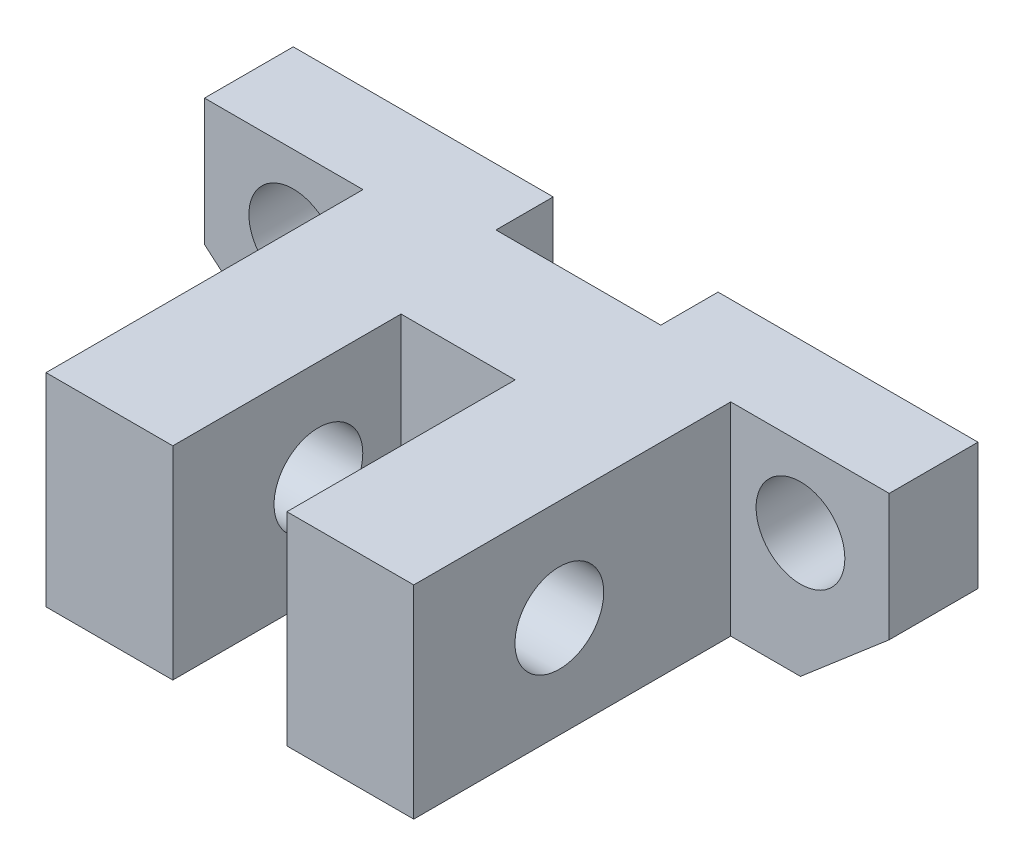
ISO-10303-21;
HEADER;
FILE_DESCRIPTION(('STEP AP214'),'2;1');
FILE_NAME('part.step','',(''),(''),'','','');
FILE_SCHEMA(('AUTOMOTIVE_DESIGN { 1 0 10303 214 1 1 1 1 }'));
ENDSEC;
DATA;
#1=APPLICATION_CONTEXT('core data for automotive mechanical design processes');
#2=APPLICATION_PROTOCOL_DEFINITION('international standard','automotive_design',2000,#1);
#3=PRODUCT_CONTEXT('',#1,'mechanical');
#4=PRODUCT('Part','Part','',(#3));
#5=PRODUCT_RELATED_PRODUCT_CATEGORY('part','',(#4));
#6=PRODUCT_DEFINITION_FORMATION('','',#4);
#7=PRODUCT_DEFINITION_CONTEXT('part definition',#1,'design');
#8=PRODUCT_DEFINITION('design','',#6,#7);
#9=PRODUCT_DEFINITION_SHAPE('','',#8);
#10=(LENGTH_UNIT() NAMED_UNIT(*) SI_UNIT(.MILLI.,.METRE.));
#11=(NAMED_UNIT(*) PLANE_ANGLE_UNIT() SI_UNIT($,.RADIAN.));
#12=(NAMED_UNIT(*) SI_UNIT($,.STERADIAN.) SOLID_ANGLE_UNIT());
#13=UNCERTAINTY_MEASURE_WITH_UNIT(LENGTH_MEASURE(1.E-05),#10,'distance_accuracy_value','');
#14=(GEOMETRIC_REPRESENTATION_CONTEXT(3) GLOBAL_UNCERTAINTY_ASSIGNED_CONTEXT((#13)) GLOBAL_UNIT_ASSIGNED_CONTEXT((#10,
#11,#12)) REPRESENTATION_CONTEXT('',''));
#15=CARTESIAN_POINT('',(0.,0.,0.));
#16=DIRECTION('',(0.,0.,1.));
#17=DIRECTION('',(1.,0.,0.));
#18=AXIS2_PLACEMENT_3D('',#15,#16,#17);
#19=CARTESIAN_POINT('',(0.,0.,0.));
#20=DIRECTION('',(0.,0.,1.));
#21=DIRECTION('',(1.,0.,0.));
#22=AXIS2_PLACEMENT_3D('',#19,#20,#21);
#23=PLANE('',#22);
#24=CARTESIAN_POINT('',(20.,1.79750346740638,0.));
#25=DIRECTION('',(0.,0.,1.));
#26=DIRECTION('',(1.,0.,0.));
#27=AXIS2_PLACEMENT_3D('',#24,#25,#26);
#28=CIRCLE('',#27,3.5);
#29=CARTESIAN_POINT('',(23.5,1.79750346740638,0.));
#30=VERTEX_POINT('',#29);
#31=EDGE_CURVE('E242',#30,#30,#28,.T.);
#32=ORIENTED_EDGE('',*,*,#31,.T.);
#33=EDGE_LOOP('',(#32));
#34=FACE_BOUND('',#33,.T.);
#35=DIRECTION('',(1.,0.,0.));
#36=VECTOR('',#35,1.);
#37=CARTESIAN_POINT('',(-20.,-8.,0.));
#38=LINE('',#37,#36);
#39=CARTESIAN_POINT('',(6.5,-8.,0.));
#40=VERTEX_POINT('',#39);
#41=CARTESIAN_POINT('',(20.,-8.,0.));
#42=VERTEX_POINT('',#41);
#43=EDGE_CURVE('E276',#40,#42,#38,.T.);
#44=ORIENTED_EDGE('',*,*,#43,.F.);
#45=DIRECTION('',(0.,1.,0.));
#46=VECTOR('',#45,1.);
#47=CARTESIAN_POINT('',(6.5,0.,0.));
#48=LINE('',#47,#46);
#49=CARTESIAN_POINT('',(6.5,8.,0.));
#50=VERTEX_POINT('',#49);
#51=EDGE_CURVE('E171',#40,#50,#48,.T.);
#52=ORIENTED_EDGE('',*,*,#51,.T.);
#53=DIRECTION('',(-1.,0.,0.));
#54=VECTOR('',#53,1.);
#55=CARTESIAN_POINT('',(-27.,8.,0.));
#56=LINE('',#55,#54);
#57=CARTESIAN_POINT('',(27.,8.,0.));
#58=VERTEX_POINT('',#57);
#59=EDGE_CURVE('E259',#58,#50,#56,.T.);
#60=ORIENTED_EDGE('',*,*,#59,.F.);
#61=DIRECTION('',(0.,1.,0.));
#62=VECTOR('',#61,1.);
#63=CARTESIAN_POINT('',(27.,8.,0.));
#64=LINE('',#63,#62);
#65=CARTESIAN_POINT('',(27.,-2.,0.));
#66=VERTEX_POINT('',#65);
#67=EDGE_CURVE('E281',#66,#58,#64,.T.);
#68=ORIENTED_EDGE('',*,*,#67,.F.);
#69=DIRECTION('',(0.759256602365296,0.650791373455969,0.));
#70=VECTOR('',#69,1.);
#71=CARTESIAN_POINT('',(20.,-8.,0.));
#72=LINE('',#71,#70);
#73=EDGE_CURVE('E279',#42,#66,#72,.T.);
#74=ORIENTED_EDGE('',*,*,#73,.F.);
#75=EDGE_LOOP('',(#44,#52,#60,#68,#74));
#76=FACE_BOUND('',#75,.T.);
#77=ADVANCED_FACE('F39',(#34,#76),#23,.F.);
#78=CARTESIAN_POINT('',(0.,0.,32.));
#79=DIRECTION('',(0.,0.,1.));
#80=DIRECTION('',(1.,0.,0.));
#81=AXIS2_PLACEMENT_3D('',#78,#79,#80);
#82=PLANE('',#81);
#83=DIRECTION('',(0.,1.,0.));
#84=VECTOR('',#83,1.);
#85=CARTESIAN_POINT('',(4.5,0.,32.));
#86=LINE('',#85,#84);
#87=CARTESIAN_POINT('',(4.5,-8.,32.));
#88=VERTEX_POINT('',#87);
#89=CARTESIAN_POINT('',(4.5,8.,32.));
#90=VERTEX_POINT('',#89);
#91=EDGE_CURVE('E305',#88,#90,#86,.T.);
#92=ORIENTED_EDGE('',*,*,#91,.F.);
#93=DIRECTION('',(1.,0.,0.));
#94=VECTOR('',#93,1.);
#95=CARTESIAN_POINT('',(-14.5,-8.,32.));
#96=LINE('',#95,#94);
#97=CARTESIAN_POINT('',(14.5,-8.,32.));
#98=VERTEX_POINT('',#97);
#99=EDGE_CURVE('E222',#88,#98,#96,.T.);
#100=ORIENTED_EDGE('',*,*,#99,.T.);
#101=DIRECTION('',(0.,1.,0.));
#102=VECTOR('',#101,1.);
#103=CARTESIAN_POINT('',(14.5,8.,32.));
#104=LINE('',#103,#102);
#105=CARTESIAN_POINT('',(14.5,8.,32.));
#106=VERTEX_POINT('',#105);
#107=EDGE_CURVE('E212',#98,#106,#104,.T.);
#108=ORIENTED_EDGE('',*,*,#107,.T.);
#109=DIRECTION('',(-1.,0.,0.));
#110=VECTOR('',#109,1.);
#111=CARTESIAN_POINT('',(-14.5,8.,32.));
#112=LINE('',#111,#110);
#113=EDGE_CURVE('E217',#106,#90,#112,.T.);
#114=ORIENTED_EDGE('',*,*,#113,.T.);
#115=EDGE_LOOP('',(#92,#100,#108,#114));
#116=FACE_BOUND('',#115,.T.);
#117=ADVANCED_FACE('F349',(#116),#82,.T.);
#118=CARTESIAN_POINT('',(0.,0.,7.));
#119=DIRECTION('',(0.,0.,1.));
#120=DIRECTION('',(1.,0.,0.));
#121=AXIS2_PLACEMENT_3D('',#118,#119,#120);
#122=PLANE('',#121);
#123=DIRECTION('',(0.,1.,0.));
#124=VECTOR('',#123,1.);
#125=CARTESIAN_POINT('',(14.5,8.,7.));
#126=LINE('',#125,#124);
#127=CARTESIAN_POINT('',(14.5,-8.,7.));
#128=VERTEX_POINT('',#127);
#129=CARTESIAN_POINT('',(14.5,8.,7.));
#130=VERTEX_POINT('',#129);
#131=EDGE_CURVE('E211',#128,#130,#126,.T.);
#132=ORIENTED_EDGE('',*,*,#131,.F.);
#133=DIRECTION('',(1.,0.,0.));
#134=VECTOR('',#133,1.);
#135=CARTESIAN_POINT('',(-20.,-8.,7.));
#136=LINE('',#135,#134);
#137=CARTESIAN_POINT('',(20.,-8.,7.));
#138=VERTEX_POINT('',#137);
#139=EDGE_CURVE('E261',#128,#138,#136,.T.);
#140=ORIENTED_EDGE('',*,*,#139,.T.);
#141=DIRECTION('',(0.759256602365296,0.650791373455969,0.));
#142=VECTOR('',#141,1.);
#143=CARTESIAN_POINT('',(20.,-8.,7.));
#144=LINE('',#143,#142);
#145=CARTESIAN_POINT('',(27.,-2.,7.));
#146=VERTEX_POINT('',#145);
#147=EDGE_CURVE('E264',#138,#146,#144,.T.);
#148=ORIENTED_EDGE('',*,*,#147,.T.);
#149=DIRECTION('',(0.,1.,0.));
#150=VECTOR('',#149,1.);
#151=CARTESIAN_POINT('',(27.,8.,7.));
#152=LINE('',#151,#150);
#153=CARTESIAN_POINT('',(27.,8.,7.));
#154=VERTEX_POINT('',#153);
#155=EDGE_CURVE('E266',#146,#154,#152,.T.);
#156=ORIENTED_EDGE('',*,*,#155,.T.);
#157=DIRECTION('',(-1.,0.,0.));
#158=VECTOR('',#157,1.);
#159=CARTESIAN_POINT('',(-27.,8.,7.));
#160=LINE('',#159,#158);
#161=EDGE_CURVE('E269',#154,#130,#160,.T.);
#162=ORIENTED_EDGE('',*,*,#161,.T.);
#163=EDGE_LOOP('',(#132,#140,#148,#156,#162));
#164=FACE_BOUND('',#163,.T.);
#165=CARTESIAN_POINT('',(20.,1.79750346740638,7.));
#166=DIRECTION('',(0.,0.,1.));
#167=DIRECTION('',(1.,0.,0.));
#168=AXIS2_PLACEMENT_3D('',#165,#166,#167);
#169=CIRCLE('',#168,3.5);
#170=CARTESIAN_POINT('',(23.5,1.79750346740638,7.));
#171=VERTEX_POINT('',#170);
#172=EDGE_CURVE('E243',#171,#171,#169,.T.);
#173=ORIENTED_EDGE('',*,*,#172,.F.);
#174=EDGE_LOOP('',(#173));
#175=FACE_BOUND('',#174,.T.);
#176=ADVANCED_FACE('F357',(#164,#175),#122,.T.);
#177=DIRECTION('',(0.,-1.,0.));
#178=VECTOR('',#177,1.);
#179=CARTESIAN_POINT('',(-14.5,8.,7.));
#180=LINE('',#179,#178);
#181=CARTESIAN_POINT('',(-14.5,8.,7.));
#182=VERTEX_POINT('',#181);
#183=CARTESIAN_POINT('',(-14.5,-8.,7.));
#184=VERTEX_POINT('',#183);
#185=EDGE_CURVE('E216',#182,#184,#180,.T.);
#186=ORIENTED_EDGE('',*,*,#185,.F.);
#187=CARTESIAN_POINT('',(-27.,8.,7.));
#188=VERTEX_POINT('',#187);
#189=EDGE_CURVE('E268',#182,#188,#160,.T.);
#190=ORIENTED_EDGE('',*,*,#189,.T.);
#191=DIRECTION('',(0.,-1.,0.));
#192=VECTOR('',#191,1.);
#193=CARTESIAN_POINT('',(-27.,8.,7.));
#194=LINE('',#193,#192);
#195=CARTESIAN_POINT('',(-27.,-2.,7.));
#196=VERTEX_POINT('',#195);
#197=EDGE_CURVE('E255',#188,#196,#194,.T.);
#198=ORIENTED_EDGE('',*,*,#197,.T.);
#199=DIRECTION('',(0.759256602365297,-0.650791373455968,0.));
#200=VECTOR('',#199,1.);
#201=CARTESIAN_POINT('',(-27.,-2.,7.));
#202=LINE('',#201,#200);
#203=CARTESIAN_POINT('',(-20.,-8.,7.));
#204=VERTEX_POINT('',#203);
#205=EDGE_CURVE('E258',#196,#204,#202,.T.);
#206=ORIENTED_EDGE('',*,*,#205,.T.);
#207=EDGE_CURVE('E262',#204,#184,#136,.T.);
#208=ORIENTED_EDGE('',*,*,#207,.T.);
#209=EDGE_LOOP('',(#186,#190,#198,#206,#208));
#210=FACE_BOUND('',#209,.T.);
#211=CARTESIAN_POINT('',(-20.,1.79750346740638,7.));
#212=DIRECTION('',(0.,0.,1.));
#213=DIRECTION('',(1.,0.,0.));
#214=AXIS2_PLACEMENT_3D('',#211,#212,#213);
#215=CIRCLE('',#214,3.5);
#216=CARTESIAN_POINT('',(-16.5,1.79750346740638,7.));
#217=VERTEX_POINT('',#216);
#218=EDGE_CURVE('E249',#217,#217,#215,.T.);
#219=ORIENTED_EDGE('',*,*,#218,.F.);
#220=EDGE_LOOP('',(#219));
#221=FACE_BOUND('',#220,.T.);
#222=ADVANCED_FACE('F383',(#210,#221),#122,.T.);
#223=CARTESIAN_POINT('',(-6.5,8.,0.));
#224=VERTEX_POINT('',#223);
#225=CARTESIAN_POINT('',(-27.,8.,0.));
#226=VERTEX_POINT('',#225);
#227=EDGE_CURVE('E283',#224,#226,#56,.T.);
#228=ORIENTED_EDGE('',*,*,#227,.F.);
#229=DIRECTION('',(0.,-1.,0.));
#230=VECTOR('',#229,1.);
#231=CARTESIAN_POINT('',(-6.5,0.,0.));
#232=LINE('',#231,#230);
#233=CARTESIAN_POINT('',(-6.5,-8.,0.));
#234=VERTEX_POINT('',#233);
#235=EDGE_CURVE('E190',#224,#234,#232,.T.);
#236=ORIENTED_EDGE('',*,*,#235,.T.);
#237=CARTESIAN_POINT('',(-20.,-8.,0.));
#238=VERTEX_POINT('',#237);
#239=EDGE_CURVE('E277',#238,#234,#38,.T.);
#240=ORIENTED_EDGE('',*,*,#239,.F.);
#241=DIRECTION('',(0.759256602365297,-0.650791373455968,0.));
#242=VECTOR('',#241,1.);
#243=CARTESIAN_POINT('',(-27.,-2.,0.));
#244=LINE('',#243,#242);
#245=CARTESIAN_POINT('',(-27.,-2.,0.));
#246=VERTEX_POINT('',#245);
#247=EDGE_CURVE('E274',#246,#238,#244,.T.);
#248=ORIENTED_EDGE('',*,*,#247,.F.);
#249=DIRECTION('',(0.,-1.,0.));
#250=VECTOR('',#249,1.);
#251=CARTESIAN_POINT('',(-27.,8.,0.));
#252=LINE('',#251,#250);
#253=EDGE_CURVE('E252',#226,#246,#252,.T.);
#254=ORIENTED_EDGE('',*,*,#253,.F.);
#255=EDGE_LOOP('',(#228,#236,#240,#248,#254));
#256=FACE_BOUND('',#255,.T.);
#257=CARTESIAN_POINT('',(-20.,1.79750346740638,0.));
#258=DIRECTION('',(0.,0.,1.));
#259=DIRECTION('',(1.,0.,0.));
#260=AXIS2_PLACEMENT_3D('',#257,#258,#259);
#261=CIRCLE('',#260,3.5);
#262=CARTESIAN_POINT('',(-16.5,1.79750346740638,0.));
#263=VERTEX_POINT('',#262);
#264=EDGE_CURVE('E246',#263,#263,#261,.T.);
#265=ORIENTED_EDGE('',*,*,#264,.T.);
#266=EDGE_LOOP('',(#265));
#267=FACE_BOUND('',#266,.T.);
#268=ADVANCED_FACE('F319',(#256,#267),#23,.F.);
#269=CARTESIAN_POINT('',(-27.,8.,7.));
#270=DIRECTION('',(1.,0.,0.));
#271=DIRECTION('',(0.,0.,-1.));
#272=AXIS2_PLACEMENT_3D('',#269,#270,#271);
#273=PLANE('',#272);
#274=ORIENTED_EDGE('',*,*,#253,.T.);
#275=DIRECTION('',(0.,0.,-1.));
#276=VECTOR('',#275,1.);
#277=CARTESIAN_POINT('',(-27.,-2.,7.));
#278=LINE('',#277,#276);
#279=EDGE_CURVE('E300',#196,#246,#278,.T.);
#280=ORIENTED_EDGE('',*,*,#279,.F.);
#281=ORIENTED_EDGE('',*,*,#197,.F.);
#282=DIRECTION('',(0.,0.,-1.));
#283=VECTOR('',#282,1.);
#284=CARTESIAN_POINT('',(-27.,8.,7.));
#285=LINE('',#284,#283);
#286=EDGE_CURVE('E271',#188,#226,#285,.T.);
#287=ORIENTED_EDGE('',*,*,#286,.T.);
#288=EDGE_LOOP('',(#274,#280,#281,#287));
#289=FACE_BOUND('',#288,.T.);
#290=ADVANCED_FACE('F41',(#289),#273,.F.);
#291=CARTESIAN_POINT('',(-27.,-2.,7.));
#292=DIRECTION('',(0.650791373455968,0.759256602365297,0.));
#293=DIRECTION('',(-0.759256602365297,0.650791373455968,0.));
#294=AXIS2_PLACEMENT_3D('',#291,#292,#293);
#295=PLANE('',#294);
#296=ORIENTED_EDGE('',*,*,#247,.T.);
#297=DIRECTION('',(0.,0.,-1.));
#298=VECTOR('',#297,1.);
#299=CARTESIAN_POINT('',(-20.,-8.,7.));
#300=LINE('',#299,#298);
#301=EDGE_CURVE('E297',#204,#238,#300,.T.);
#302=ORIENTED_EDGE('',*,*,#301,.F.);
#303=ORIENTED_EDGE('',*,*,#205,.F.);
#304=ORIENTED_EDGE('',*,*,#279,.T.);
#305=EDGE_LOOP('',(#296,#302,#303,#304));
#306=FACE_BOUND('',#305,.T.);
#307=ADVANCED_FACE('F388',(#306),#295,.F.);
#308=CARTESIAN_POINT('',(-20.,-8.,7.));
#309=DIRECTION('',(0.,1.,0.));
#310=DIRECTION('',(-1.,0.,0.));
#311=AXIS2_PLACEMENT_3D('',#308,#309,#310);
#312=PLANE('',#311);
#313=DIRECTION('',(-1.,0.,0.));
#314=VECTOR('',#313,1.);
#315=CARTESIAN_POINT('',(-6.5,-8.,4.51653939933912));
#316=LINE('',#315,#314);
#317=CARTESIAN_POINT('',(6.5,-8.,4.51653939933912));
#318=VERTEX_POINT('',#317);
#319=CARTESIAN_POINT('',(-6.5,-8.,4.51653939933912));
#320=VERTEX_POINT('',#319);
#321=EDGE_CURVE('E175',#318,#320,#316,.T.);
#322=ORIENTED_EDGE('',*,*,#321,.F.);
#323=DIRECTION('',(0.,0.,1.));
#324=VECTOR('',#323,1.);
#325=CARTESIAN_POINT('',(6.5,-8.,4.51653939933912));
#326=LINE('',#325,#324);
#327=EDGE_CURVE('E166',#40,#318,#326,.T.);
#328=ORIENTED_EDGE('',*,*,#327,.F.);
#329=ORIENTED_EDGE('',*,*,#43,.T.);
#330=DIRECTION('',(0.,0.,-1.));
#331=VECTOR('',#330,1.);
#332=CARTESIAN_POINT('',(20.,-8.,7.));
#333=LINE('',#332,#331);
#334=EDGE_CURVE('E294',#138,#42,#333,.T.);
#335=ORIENTED_EDGE('',*,*,#334,.F.);
#336=ORIENTED_EDGE('',*,*,#139,.F.);
#337=DIRECTION('',(0.,0.,-1.));
#338=VECTOR('',#337,1.);
#339=CARTESIAN_POINT('',(14.5,-8.,32.));
#340=LINE('',#339,#338);
#341=EDGE_CURVE('E226',#98,#128,#340,.T.);
#342=ORIENTED_EDGE('',*,*,#341,.F.);
#343=ORIENTED_EDGE('',*,*,#99,.F.);
#344=DIRECTION('',(0.,0.,1.));
#345=VECTOR('',#344,1.);
#346=CARTESIAN_POINT('',(4.5,-8.,50.));
#347=LINE('',#346,#345);
#348=CARTESIAN_POINT('',(4.5,-8.,14.));
#349=VERTEX_POINT('',#348);
#350=EDGE_CURVE('E195',#349,#88,#347,.T.);
#351=ORIENTED_EDGE('',*,*,#350,.F.);
#352=DIRECTION('',(1.,0.,0.));
#353=VECTOR('',#352,1.);
#354=CARTESIAN_POINT('',(-4.5,-8.,14.));
#355=LINE('',#354,#353);
#356=CARTESIAN_POINT('',(-4.5,-8.,14.));
#357=VERTEX_POINT('',#356);
#358=EDGE_CURVE('E200',#357,#349,#355,.T.);
#359=ORIENTED_EDGE('',*,*,#358,.F.);
#360=DIRECTION('',(0.,0.,-1.));
#361=VECTOR('',#360,1.);
#362=CARTESIAN_POINT('',(-4.5,-8.,50.));
#363=LINE('',#362,#361);
#364=CARTESIAN_POINT('',(-4.5,-8.,32.));
#365=VERTEX_POINT('',#364);
#366=EDGE_CURVE('E197',#365,#357,#363,.T.);
#367=ORIENTED_EDGE('',*,*,#366,.F.);
#368=CARTESIAN_POINT('',(-14.5,-8.,32.));
#369=VERTEX_POINT('',#368);
#370=EDGE_CURVE('E223',#369,#365,#96,.T.);
#371=ORIENTED_EDGE('',*,*,#370,.F.);
#372=DIRECTION('',(0.,0.,-1.));
#373=VECTOR('',#372,1.);
#374=CARTESIAN_POINT('',(-14.5,-8.,32.));
#375=LINE('',#374,#373);
#376=EDGE_CURVE('E233',#369,#184,#375,.T.);
#377=ORIENTED_EDGE('',*,*,#376,.T.);
#378=ORIENTED_EDGE('',*,*,#207,.F.);
#379=ORIENTED_EDGE('',*,*,#301,.T.);
#380=ORIENTED_EDGE('',*,*,#239,.T.);
#381=DIRECTION('',(0.,0.,-1.));
#382=VECTOR('',#381,1.);
#383=CARTESIAN_POINT('',(-6.5,-8.,4.51653939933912));
#384=LINE('',#383,#382);
#385=EDGE_CURVE('E182',#320,#234,#384,.T.);
#386=ORIENTED_EDGE('',*,*,#385,.F.);
#387=EDGE_LOOP('',(#322,#328,#329,#335,#336,#342,#343,#351,#359,#367,#371,#377,#378,#379,#380,#386));
#388=FACE_BOUND('',#387,.T.);
#389=ADVANCED_FACE('F184',(#388),#312,.F.);
#390=CARTESIAN_POINT('',(20.,-8.,7.));
#391=DIRECTION('',(-0.650791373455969,0.759256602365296,0.));
#392=DIRECTION('',(-0.759256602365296,-0.650791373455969,0.));
#393=AXIS2_PLACEMENT_3D('',#390,#391,#392);
#394=PLANE('',#393);
#395=ORIENTED_EDGE('',*,*,#73,.T.);
#396=DIRECTION('',(0.,0.,-1.));
#397=VECTOR('',#396,1.);
#398=CARTESIAN_POINT('',(27.,-2.,7.));
#399=LINE('',#398,#397);
#400=EDGE_CURVE('E291',#146,#66,#399,.T.);
#401=ORIENTED_EDGE('',*,*,#400,.F.);
#402=ORIENTED_EDGE('',*,*,#147,.F.);
#403=ORIENTED_EDGE('',*,*,#334,.T.);
#404=EDGE_LOOP('',(#395,#401,#402,#403));
#405=FACE_BOUND('',#404,.T.);
#406=ADVANCED_FACE('F364',(#405),#394,.F.);
#407=CARTESIAN_POINT('',(27.,8.,7.));
#408=DIRECTION('',(-1.,0.,0.));
#409=DIRECTION('',(0.,0.,1.));
#410=AXIS2_PLACEMENT_3D('',#407,#408,#409);
#411=PLANE('',#410);
#412=ORIENTED_EDGE('',*,*,#67,.T.);
#413=DIRECTION('',(0.,0.,-1.));
#414=VECTOR('',#413,1.);
#415=CARTESIAN_POINT('',(27.,8.,7.));
#416=LINE('',#415,#414);
#417=EDGE_CURVE('E288',#154,#58,#416,.T.);
#418=ORIENTED_EDGE('',*,*,#417,.F.);
#419=ORIENTED_EDGE('',*,*,#155,.F.);
#420=ORIENTED_EDGE('',*,*,#400,.T.);
#421=EDGE_LOOP('',(#412,#418,#419,#420));
#422=FACE_BOUND('',#421,.T.);
#423=ADVANCED_FACE('F368',(#422),#411,.F.);
#424=CARTESIAN_POINT('',(-27.,8.,7.));
#425=DIRECTION('',(0.,-1.,0.));
#426=DIRECTION('',(0.,0.,-1.));
#427=AXIS2_PLACEMENT_3D('',#424,#425,#426);
#428=PLANE('',#427);
#429=ORIENTED_EDGE('',*,*,#59,.T.);
#430=DIRECTION('',(0.,0.,1.));
#431=VECTOR('',#430,1.);
#432=CARTESIAN_POINT('',(6.5,8.,7.00000000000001));
#433=LINE('',#432,#431);
#434=CARTESIAN_POINT('',(6.5,8.,4.51653939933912));
#435=VERTEX_POINT('',#434);
#436=EDGE_CURVE('E11',#50,#435,#433,.T.);
#437=ORIENTED_EDGE('',*,*,#436,.T.);
#438=DIRECTION('',(-1.,0.,0.));
#439=VECTOR('',#438,1.);
#440=CARTESIAN_POINT('',(-27.,8.,4.51653939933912));
#441=LINE('',#440,#439);
#442=CARTESIAN_POINT('',(-6.5,8.,4.51653939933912));
#443=VERTEX_POINT('',#442);
#444=EDGE_CURVE('E181',#435,#443,#441,.T.);
#445=ORIENTED_EDGE('',*,*,#444,.T.);
#446=DIRECTION('',(0.,0.,-1.));
#447=VECTOR('',#446,1.);
#448=CARTESIAN_POINT('',(-6.5,8.,7.));
#449=LINE('',#448,#447);
#450=EDGE_CURVE('E48',#443,#224,#449,.T.);
#451=ORIENTED_EDGE('',*,*,#450,.T.);
#452=ORIENTED_EDGE('',*,*,#227,.T.);
#453=ORIENTED_EDGE('',*,*,#286,.F.);
#454=ORIENTED_EDGE('',*,*,#189,.F.);
#455=DIRECTION('',(0.,0.,-1.));
#456=VECTOR('',#455,1.);
#457=CARTESIAN_POINT('',(-14.5,8.,32.));
#458=LINE('',#457,#456);
#459=CARTESIAN_POINT('',(-14.5,8.,32.));
#460=VERTEX_POINT('',#459);
#461=EDGE_CURVE('E236',#460,#182,#458,.T.);
#462=ORIENTED_EDGE('',*,*,#461,.F.);
#463=CARTESIAN_POINT('',(-4.5,8.,32.));
#464=VERTEX_POINT('',#463);
#465=EDGE_CURVE('E215',#464,#460,#112,.T.);
#466=ORIENTED_EDGE('',*,*,#465,.F.);
#467=DIRECTION('',(0.,0.,-1.));
#468=VECTOR('',#467,1.);
#469=CARTESIAN_POINT('',(-4.5,8.,7.));
#470=LINE('',#469,#468);
#471=CARTESIAN_POINT('',(-4.5,8.,14.));
#472=VERTEX_POINT('',#471);
#473=EDGE_CURVE('E63',#464,#472,#470,.T.);
#474=ORIENTED_EDGE('',*,*,#473,.T.);
#475=DIRECTION('',(1.,0.,0.));
#476=VECTOR('',#475,1.);
#477=CARTESIAN_POINT('',(-27.,8.,14.));
#478=LINE('',#477,#476);
#479=CARTESIAN_POINT('',(4.5,8.,14.));
#480=VERTEX_POINT('',#479);
#481=EDGE_CURVE('E307',#472,#480,#478,.T.);
#482=ORIENTED_EDGE('',*,*,#481,.T.);
#483=DIRECTION('',(0.,0.,1.));
#484=VECTOR('',#483,1.);
#485=CARTESIAN_POINT('',(4.50000000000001,8.,7.));
#486=LINE('',#485,#484);
#487=EDGE_CURVE('E208',#480,#90,#486,.T.);
#488=ORIENTED_EDGE('',*,*,#487,.T.);
#489=ORIENTED_EDGE('',*,*,#113,.F.);
#490=DIRECTION('',(0.,0.,-1.));
#491=VECTOR('',#490,1.);
#492=CARTESIAN_POINT('',(14.5,8.,32.));
#493=LINE('',#492,#491);
#494=EDGE_CURVE('E239',#106,#130,#493,.T.);
#495=ORIENTED_EDGE('',*,*,#494,.T.);
#496=ORIENTED_EDGE('',*,*,#161,.F.);
#497=ORIENTED_EDGE('',*,*,#417,.T.);
#498=EDGE_LOOP('',(#429,#437,#445,#451,#452,#453,#454,#462,#466,#474,#482,#488,#489,#495,#496,#497));
#499=FACE_BOUND('',#498,.T.);
#500=ADVANCED_FACE('F314',(#499),#428,.F.);
#501=CARTESIAN_POINT('',(-20.,1.79750346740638,7.));
#502=DIRECTION('',(0.,0.,-1.));
#503=DIRECTION('',(-1.,0.,0.));
#504=AXIS2_PLACEMENT_3D('',#501,#502,#503);
#505=CYLINDRICAL_SURFACE('',#504,3.5);
#506=ORIENTED_EDGE('',*,*,#218,.T.);
#507=EDGE_LOOP('',(#506));
#508=FACE_BOUND('',#507,.T.);
#509=ORIENTED_EDGE('',*,*,#264,.F.);
#510=EDGE_LOOP('',(#509));
#511=FACE_BOUND('',#510,.T.);
#512=ADVANCED_FACE('F395',(#508,#511),#505,.F.);
#513=CARTESIAN_POINT('',(20.,1.79750346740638,7.));
#514=DIRECTION('',(0.,0.,-1.));
#515=DIRECTION('',(-1.,0.,0.));
#516=AXIS2_PLACEMENT_3D('',#513,#514,#515);
#517=CYLINDRICAL_SURFACE('',#516,3.5);
#518=ORIENTED_EDGE('',*,*,#172,.T.);
#519=EDGE_LOOP('',(#518));
#520=FACE_BOUND('',#519,.T.);
#521=ORIENTED_EDGE('',*,*,#31,.F.);
#522=EDGE_LOOP('',(#521));
#523=FACE_BOUND('',#522,.T.);
#524=ADVANCED_FACE('F398',(#520,#523),#517,.F.);
#525=CARTESIAN_POINT('',(14.5,8.,32.));
#526=DIRECTION('',(-1.,0.,0.));
#527=DIRECTION('',(0.,0.,1.));
#528=AXIS2_PLACEMENT_3D('',#525,#526,#527);
#529=PLANE('',#528);
#530=CARTESIAN_POINT('',(14.5,0.,20.5165393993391));
#531=DIRECTION('',(1.,0.,0.));
#532=DIRECTION('',(0.,0.,-1.));
#533=AXIS2_PLACEMENT_3D('',#530,#531,#532);
#534=CIRCLE('',#533,3.5);
#535=CARTESIAN_POINT('',(14.5,0.,17.0165393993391));
#536=VERTEX_POINT('',#535);
#537=EDGE_CURVE('E441',#536,#536,#534,.T.);
#538=ORIENTED_EDGE('',*,*,#537,.F.);
#539=EDGE_LOOP('',(#538));
#540=FACE_BOUND('',#539,.T.);
#541=ORIENTED_EDGE('',*,*,#131,.T.);
#542=ORIENTED_EDGE('',*,*,#494,.F.);
#543=ORIENTED_EDGE('',*,*,#107,.F.);
#544=ORIENTED_EDGE('',*,*,#341,.T.);
#545=EDGE_LOOP('',(#541,#542,#543,#544));
#546=FACE_BOUND('',#545,.T.);
#547=ADVANCED_FACE('F354',(#540,#546),#529,.F.);
#548=CARTESIAN_POINT('',(-14.5,8.,32.));
#549=DIRECTION('',(1.,0.,0.));
#550=DIRECTION('',(0.,1.,0.));
#551=AXIS2_PLACEMENT_3D('',#548,#549,#550);
#552=PLANE('',#551);
#553=CARTESIAN_POINT('',(-14.5,0.,20.5165393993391));
#554=DIRECTION('',(1.,0.,0.));
#555=DIRECTION('',(0.,1.,0.));
#556=AXIS2_PLACEMENT_3D('',#553,#554,#555);
#557=CIRCLE('',#556,3.5);
#558=CARTESIAN_POINT('',(-14.5,0.,17.0165393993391));
#559=VERTEX_POINT('',#558);
#560=EDGE_CURVE('E176',#559,#559,#557,.T.);
#561=ORIENTED_EDGE('',*,*,#560,.T.);
#562=EDGE_LOOP('',(#561));
#563=FACE_BOUND('',#562,.T.);
#564=ORIENTED_EDGE('',*,*,#185,.T.);
#565=ORIENTED_EDGE('',*,*,#376,.F.);
#566=DIRECTION('',(0.,-1.,0.));
#567=VECTOR('',#566,1.);
#568=CARTESIAN_POINT('',(-14.5,8.,32.));
#569=LINE('',#568,#567);
#570=EDGE_CURVE('E220',#460,#369,#569,.T.);
#571=ORIENTED_EDGE('',*,*,#570,.F.);
#572=ORIENTED_EDGE('',*,*,#461,.T.);
#573=EDGE_LOOP('',(#564,#565,#571,#572));
#574=FACE_BOUND('',#573,.T.);
#575=ADVANCED_FACE('F331',(#563,#574),#552,.F.);
#576=DIRECTION('',(0.,-1.,0.));
#577=VECTOR('',#576,1.);
#578=CARTESIAN_POINT('',(-4.5,0.,32.));
#579=LINE('',#578,#577);
#580=EDGE_CURVE('E303',#464,#365,#579,.T.);
#581=ORIENTED_EDGE('',*,*,#580,.F.);
#582=ORIENTED_EDGE('',*,*,#465,.T.);
#583=ORIENTED_EDGE('',*,*,#570,.T.);
#584=ORIENTED_EDGE('',*,*,#370,.T.);
#585=EDGE_LOOP('',(#581,#582,#583,#584));
#586=FACE_BOUND('',#585,.T.);
#587=ADVANCED_FACE('F335',(#586),#82,.T.);
#588=CARTESIAN_POINT('',(-4.5,17.,14.));
#589=DIRECTION('',(0.,0.,-1.));
#590=DIRECTION('',(-1.,0.,0.));
#591=AXIS2_PLACEMENT_3D('',#588,#589,#590);
#592=PLANE('',#591);
#593=DIRECTION('',(0.,-1.,0.));
#594=VECTOR('',#593,1.);
#595=CARTESIAN_POINT('',(-4.5,17.,14.));
#596=LINE('',#595,#594);
#597=EDGE_CURVE('E203',#472,#357,#596,.T.);
#598=ORIENTED_EDGE('',*,*,#597,.T.);
#599=ORIENTED_EDGE('',*,*,#358,.T.);
#600=DIRECTION('',(0.,-1.,0.));
#601=VECTOR('',#600,1.);
#602=CARTESIAN_POINT('',(4.5,17.,14.));
#603=LINE('',#602,#601);
#604=EDGE_CURVE('E204',#480,#349,#603,.T.);
#605=ORIENTED_EDGE('',*,*,#604,.F.);
#606=ORIENTED_EDGE('',*,*,#481,.F.);
#607=EDGE_LOOP('',(#598,#599,#605,#606));
#608=FACE_BOUND('',#607,.T.);
#609=ADVANCED_FACE('F338',(#608),#592,.F.);
#610=CARTESIAN_POINT('',(4.5,17.,50.));
#611=DIRECTION('',(1.,0.,0.));
#612=DIRECTION('',(0.,0.,-1.));
#613=AXIS2_PLACEMENT_3D('',#610,#611,#612);
#614=PLANE('',#613);
#615=CARTESIAN_POINT('',(4.5,0.,20.5165393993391));
#616=DIRECTION('',(1.,0.,0.));
#617=DIRECTION('',(0.,0.,-1.));
#618=AXIS2_PLACEMENT_3D('',#615,#616,#617);
#619=CIRCLE('',#618,3.5);
#620=CARTESIAN_POINT('',(4.50000000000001,0.,17.0165393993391));
#621=VERTEX_POINT('',#620);
#622=EDGE_CURVE('E437',#621,#621,#619,.T.);
#623=ORIENTED_EDGE('',*,*,#622,.T.);
#624=EDGE_LOOP('',(#623));
#625=FACE_BOUND('',#624,.T.);
#626=ORIENTED_EDGE('',*,*,#604,.T.);
#627=ORIENTED_EDGE('',*,*,#350,.T.);
#628=ORIENTED_EDGE('',*,*,#91,.T.);
#629=ORIENTED_EDGE('',*,*,#487,.F.);
#630=EDGE_LOOP('',(#626,#627,#628,#629));
#631=FACE_BOUND('',#630,.T.);
#632=ADVANCED_FACE('F347',(#625,#631),#614,.F.);
#633=CARTESIAN_POINT('',(-4.5,17.,50.));
#634=DIRECTION('',(-1.,0.,0.));
#635=DIRECTION('',(0.,0.,1.));
#636=AXIS2_PLACEMENT_3D('',#633,#634,#635);
#637=PLANE('',#636);
#638=CARTESIAN_POINT('',(-4.5,0.,20.5165393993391));
#639=DIRECTION('',(-1.,0.,0.));
#640=DIRECTION('',(0.,0.,1.));
#641=AXIS2_PLACEMENT_3D('',#638,#639,#640);
#642=CIRCLE('',#641,3.5);
#643=CARTESIAN_POINT('',(-4.49999999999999,0.,17.0165393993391));
#644=VERTEX_POINT('',#643);
#645=EDGE_CURVE('E43',#644,#644,#642,.T.);
#646=ORIENTED_EDGE('',*,*,#645,.T.);
#647=EDGE_LOOP('',(#646));
#648=FACE_BOUND('',#647,.T.);
#649=ORIENTED_EDGE('',*,*,#580,.T.);
#650=ORIENTED_EDGE('',*,*,#366,.T.);
#651=ORIENTED_EDGE('',*,*,#597,.F.);
#652=ORIENTED_EDGE('',*,*,#473,.F.);
#653=EDGE_LOOP('',(#649,#650,#651,#652));
#654=FACE_BOUND('',#653,.T.);
#655=ADVANCED_FACE('F339',(#648,#654),#637,.F.);
#656=CARTESIAN_POINT('',(6.5,17.,4.51653939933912));
#657=DIRECTION('',(1.,0.,0.));
#658=DIRECTION('',(0.,0.,-1.));
#659=AXIS2_PLACEMENT_3D('',#656,#657,#658);
#660=PLANE('',#659);
#661=ORIENTED_EDGE('',*,*,#327,.T.);
#662=DIRECTION('',(0.,-1.,0.));
#663=VECTOR('',#662,1.);
#664=CARTESIAN_POINT('',(6.5,17.,4.51653939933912));
#665=LINE('',#664,#663);
#666=EDGE_CURVE('E169',#435,#318,#665,.T.);
#667=ORIENTED_EDGE('',*,*,#666,.F.);
#668=ORIENTED_EDGE('',*,*,#436,.F.);
#669=ORIENTED_EDGE('',*,*,#51,.F.);
#670=EDGE_LOOP('',(#661,#667,#668,#669));
#671=FACE_BOUND('',#670,.T.);
#672=ADVANCED_FACE('F168',(#671),#660,.F.);
#673=CARTESIAN_POINT('',(-6.5,17.,4.51653939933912));
#674=DIRECTION('',(-1.,0.,0.));
#675=DIRECTION('',(0.,0.,1.));
#676=AXIS2_PLACEMENT_3D('',#673,#674,#675);
#677=PLANE('',#676);
#678=ORIENTED_EDGE('',*,*,#450,.F.);
#679=DIRECTION('',(0.,-1.,0.));
#680=VECTOR('',#679,1.);
#681=CARTESIAN_POINT('',(-6.5,17.,4.51653939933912));
#682=LINE('',#681,#680);
#683=EDGE_CURVE('E55',#443,#320,#682,.T.);
#684=ORIENTED_EDGE('',*,*,#683,.T.);
#685=ORIENTED_EDGE('',*,*,#385,.T.);
#686=ORIENTED_EDGE('',*,*,#235,.F.);
#687=EDGE_LOOP('',(#678,#684,#685,#686));
#688=FACE_BOUND('',#687,.T.);
#689=ADVANCED_FACE('F419',(#688),#677,.F.);
#690=CARTESIAN_POINT('',(-6.5,17.,4.51653939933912));
#691=DIRECTION('',(0.,0.,1.));
#692=DIRECTION('',(1.,0.,0.));
#693=AXIS2_PLACEMENT_3D('',#690,#691,#692);
#694=PLANE('',#693);
#695=ORIENTED_EDGE('',*,*,#666,.T.);
#696=ORIENTED_EDGE('',*,*,#321,.T.);
#697=ORIENTED_EDGE('',*,*,#683,.F.);
#698=ORIENTED_EDGE('',*,*,#444,.F.);
#699=EDGE_LOOP('',(#695,#696,#697,#698));
#700=FACE_BOUND('',#699,.T.);
#701=ADVANCED_FACE('F178',(#700),#694,.F.);
#702=CARTESIAN_POINT('',(-27.,0.,20.5165393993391));
#703=DIRECTION('',(1.,0.,0.));
#704=DIRECTION('',(0.,0.,-1.));
#705=AXIS2_PLACEMENT_3D('',#702,#703,#704);
#706=CYLINDRICAL_SURFACE('',#705,3.5);
#707=CARTESIAN_POINT('',(-4.49999999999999,0.,17.0165393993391));
#708=CARTESIAN_POINT('',(-4.60416666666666,0.,17.0165393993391));
#709=CARTESIAN_POINT('',(-4.70833333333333,0.,17.0165393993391));
#710=CARTESIAN_POINT('',(-4.91666666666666,0.,17.0165393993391));
#711=CARTESIAN_POINT('',(-5.02083333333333,0.,17.0165393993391));
#712=CARTESIAN_POINT('',(-5.22916666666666,0.,17.0165393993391));
#713=CARTESIAN_POINT('',(-5.33333333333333,0.,17.0165393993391));
#714=CARTESIAN_POINT('',(-5.54166666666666,0.,17.0165393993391));
#715=CARTESIAN_POINT('',(-5.64583333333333,0.,17.0165393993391));
#716=CARTESIAN_POINT('',(-5.85416666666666,0.,17.0165393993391));
#717=CARTESIAN_POINT('',(-5.95833333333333,0.,17.0165393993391));
#718=CARTESIAN_POINT('',(-6.16666666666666,0.,17.0165393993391));
#719=CARTESIAN_POINT('',(-6.27083333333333,0.,17.0165393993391));
#720=CARTESIAN_POINT('',(-6.47916666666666,0.,17.0165393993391));
#721=CARTESIAN_POINT('',(-6.58333333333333,0.,17.0165393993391));
#722=CARTESIAN_POINT('',(-6.79166666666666,0.,17.0165393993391));
#723=CARTESIAN_POINT('',(-6.89583333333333,0.,17.0165393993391));
#724=CARTESIAN_POINT('',(-7.10416666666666,0.,17.0165393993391));
#725=CARTESIAN_POINT('',(-7.20833333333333,0.,17.0165393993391));
#726=CARTESIAN_POINT('',(-7.41666666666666,0.,17.0165393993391));
#727=CARTESIAN_POINT('',(-7.52083333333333,0.,17.0165393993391));
#728=CARTESIAN_POINT('',(-7.72916666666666,0.,17.0165393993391));
#729=CARTESIAN_POINT('',(-7.83333333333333,0.,17.0165393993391));
#730=CARTESIAN_POINT('',(-8.04166666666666,0.,17.0165393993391));
#731=CARTESIAN_POINT('',(-8.14583333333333,0.,17.0165393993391));
#732=CARTESIAN_POINT('',(-8.35416666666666,0.,17.0165393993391));
#733=CARTESIAN_POINT('',(-8.45833333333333,0.,17.0165393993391));
#734=CARTESIAN_POINT('',(-8.66666666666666,0.,17.0165393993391));
#735=CARTESIAN_POINT('',(-8.77083333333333,0.,17.0165393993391));
#736=CARTESIAN_POINT('',(-8.97916666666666,0.,17.0165393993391));
#737=CARTESIAN_POINT('',(-9.08333333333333,0.,17.0165393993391));
#738=CARTESIAN_POINT('',(-9.29166666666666,0.,17.0165393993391));
#739=CARTESIAN_POINT('',(-9.39583333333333,0.,17.0165393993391));
#740=CARTESIAN_POINT('',(-9.60416666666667,0.,17.0165393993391));
#741=CARTESIAN_POINT('',(-9.70833333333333,0.,17.0165393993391));
#742=CARTESIAN_POINT('',(-9.91666666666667,0.,17.0165393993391));
#743=CARTESIAN_POINT('',(-10.0208333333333,0.,17.0165393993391));
#744=CARTESIAN_POINT('',(-10.2291666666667,0.,17.0165393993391));
#745=CARTESIAN_POINT('',(-10.3333333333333,0.,17.0165393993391));
#746=CARTESIAN_POINT('',(-10.5416666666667,0.,17.0165393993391));
#747=CARTESIAN_POINT('',(-10.6458333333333,0.,17.0165393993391));
#748=CARTESIAN_POINT('',(-10.8541666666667,0.,17.0165393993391));
#749=CARTESIAN_POINT('',(-10.9583333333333,0.,17.0165393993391));
#750=CARTESIAN_POINT('',(-11.1666666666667,0.,17.0165393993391));
#751=CARTESIAN_POINT('',(-11.2708333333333,0.,17.0165393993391));
#752=CARTESIAN_POINT('',(-11.4791666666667,0.,17.0165393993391));
#753=CARTESIAN_POINT('',(-11.5833333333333,0.,17.0165393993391));
#754=CARTESIAN_POINT('',(-11.7916666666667,0.,17.0165393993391));
#755=CARTESIAN_POINT('',(-11.8958333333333,0.,17.0165393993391));
#756=CARTESIAN_POINT('',(-12.1041666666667,0.,17.0165393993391));
#757=CARTESIAN_POINT('',(-12.2083333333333,0.,17.0165393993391));
#758=CARTESIAN_POINT('',(-12.4166666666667,0.,17.0165393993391));
#759=CARTESIAN_POINT('',(-12.5208333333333,0.,17.0165393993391));
#760=CARTESIAN_POINT('',(-12.7291666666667,0.,17.0165393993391));
#761=CARTESIAN_POINT('',(-12.8333333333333,0.,17.0165393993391));
#762=CARTESIAN_POINT('',(-13.0416666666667,0.,17.0165393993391));
#763=CARTESIAN_POINT('',(-13.1458333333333,0.,17.0165393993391));
#764=CARTESIAN_POINT('',(-13.3541666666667,0.,17.0165393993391));
#765=CARTESIAN_POINT('',(-13.4583333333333,0.,17.0165393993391));
#766=CARTESIAN_POINT('',(-13.6666666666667,0.,17.0165393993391));
#767=CARTESIAN_POINT('',(-13.7708333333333,0.,17.0165393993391));
#768=CARTESIAN_POINT('',(-13.9791666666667,0.,17.0165393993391));
#769=CARTESIAN_POINT('',(-14.0833333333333,0.,17.0165393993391));
#770=CARTESIAN_POINT('',(-14.2916666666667,0.,17.0165393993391));
#771=CARTESIAN_POINT('',(-14.3958333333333,0.,17.0165393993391));
#772=CARTESIAN_POINT('',(-14.5,0.,17.0165393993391));
#773=B_SPLINE_CURVE_WITH_KNOTS('',3,(#707,#708,#709,#710,#711,#712,#713,#714,#715,#716,#717,
#718,#719,#720,#721,#722,#723,#724,#725,#726,#727,#728,#729,#730,#731,#732,#733,#734,#735,#736,
#737,#738,#739,#740,#741,#742,#743,#744,#745,#746,#747,#748,#749,#750,#751,#752,#753,#754,#755,
#756,#757,#758,#759,#760,#761,#762,#763,#764,#765,#766,#767,#768,#769,#770,#771,#772),
.UNSPECIFIED.,.F.,.F.,(4,2,2,2,2,2,2,2,2,2,2,2,2,2,2,2,2,2,2,2,2,2,2,2,2,2,2,2,2,2,2,2,4),(0.,
0.3125,0.625000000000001,0.937500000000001,1.25,1.5625,1.875,2.1875,2.5,2.8125,3.125,3.4375,
3.75,4.0625,4.375,4.6875,5.,5.3125,5.62500000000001,5.93750000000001,6.25000000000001,
6.56250000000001,6.875,7.1875,7.50000000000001,7.81250000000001,8.12500000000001,
8.43750000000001,8.75000000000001,9.06250000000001,9.37500000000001,9.68750000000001,10.),.UNSPECIFIED.);
#774=EDGE_CURVE('BSEAM422',#644,#559,#773,.T.);
#775=ORIENTED_EDGE('',*,*,#645,.F.);
#776=ORIENTED_EDGE('',*,*,#560,.F.);
#777=ORIENTED_EDGE('',*,*,#774,.T.);
#778=ORIENTED_EDGE('',*,*,#774,.F.);
#779=EDGE_LOOP('',(#775,#777,#776,#778));
#780=FACE_BOUND('',#779,.T.);
#781=ADVANCED_FACE('F422',(#780),#706,.F.);
#782=CARTESIAN_POINT('',(14.5,0.,17.0165393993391));
#783=CARTESIAN_POINT('',(14.3958333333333,0.,17.0165393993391));
#784=CARTESIAN_POINT('',(14.2916666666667,0.,17.0165393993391));
#785=CARTESIAN_POINT('',(14.0833333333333,0.,17.0165393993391));
#786=CARTESIAN_POINT('',(13.9791666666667,0.,17.0165393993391));
#787=CARTESIAN_POINT('',(13.7708333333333,0.,17.0165393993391));
#788=CARTESIAN_POINT('',(13.6666666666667,0.,17.0165393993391));
#789=CARTESIAN_POINT('',(13.4583333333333,0.,17.0165393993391));
#790=CARTESIAN_POINT('',(13.3541666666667,0.,17.0165393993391));
#791=CARTESIAN_POINT('',(13.1458333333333,0.,17.0165393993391));
#792=CARTESIAN_POINT('',(13.0416666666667,0.,17.0165393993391));
#793=CARTESIAN_POINT('',(12.8333333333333,0.,17.0165393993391));
#794=CARTESIAN_POINT('',(12.7291666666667,0.,17.0165393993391));
#795=CARTESIAN_POINT('',(12.5208333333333,0.,17.0165393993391));
#796=CARTESIAN_POINT('',(12.4166666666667,0.,17.0165393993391));
#797=CARTESIAN_POINT('',(12.2083333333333,0.,17.0165393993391));
#798=CARTESIAN_POINT('',(12.1041666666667,0.,17.0165393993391));
#799=CARTESIAN_POINT('',(11.8958333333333,0.,17.0165393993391));
#800=CARTESIAN_POINT('',(11.7916666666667,0.,17.0165393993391));
#801=CARTESIAN_POINT('',(11.5833333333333,0.,17.0165393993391));
#802=CARTESIAN_POINT('',(11.4791666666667,0.,17.0165393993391));
#803=CARTESIAN_POINT('',(11.2708333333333,0.,17.0165393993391));
#804=CARTESIAN_POINT('',(11.1666666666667,0.,17.0165393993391));
#805=CARTESIAN_POINT('',(10.9583333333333,0.,17.0165393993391));
#806=CARTESIAN_POINT('',(10.8541666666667,0.,17.0165393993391));
#807=CARTESIAN_POINT('',(10.6458333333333,0.,17.0165393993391));
#808=CARTESIAN_POINT('',(10.5416666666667,0.,17.0165393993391));
#809=CARTESIAN_POINT('',(10.3333333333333,0.,17.0165393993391));
#810=CARTESIAN_POINT('',(10.2291666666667,0.,17.0165393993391));
#811=CARTESIAN_POINT('',(10.0208333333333,0.,17.0165393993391));
#812=CARTESIAN_POINT('',(9.91666666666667,0.,17.0165393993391));
#813=CARTESIAN_POINT('',(9.70833333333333,0.,17.0165393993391));
#814=CARTESIAN_POINT('',(9.60416666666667,0.,17.0165393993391));
#815=CARTESIAN_POINT('',(9.39583333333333,0.,17.0165393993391));
#816=CARTESIAN_POINT('',(9.29166666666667,0.,17.0165393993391));
#817=CARTESIAN_POINT('',(9.08333333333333,0.,17.0165393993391));
#818=CARTESIAN_POINT('',(8.97916666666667,0.,17.0165393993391));
#819=CARTESIAN_POINT('',(8.77083333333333,0.,17.0165393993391));
#820=CARTESIAN_POINT('',(8.66666666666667,0.,17.0165393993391));
#821=CARTESIAN_POINT('',(8.45833333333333,0.,17.0165393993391));
#822=CARTESIAN_POINT('',(8.35416666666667,0.,17.0165393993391));
#823=CARTESIAN_POINT('',(8.14583333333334,0.,17.0165393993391));
#824=CARTESIAN_POINT('',(8.04166666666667,0.,17.0165393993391));
#825=CARTESIAN_POINT('',(7.83333333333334,0.,17.0165393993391));
#826=CARTESIAN_POINT('',(7.72916666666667,0.,17.0165393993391));
#827=CARTESIAN_POINT('',(7.52083333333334,0.,17.0165393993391));
#828=CARTESIAN_POINT('',(7.41666666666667,0.,17.0165393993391));
#829=CARTESIAN_POINT('',(7.20833333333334,0.,17.0165393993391));
#830=CARTESIAN_POINT('',(7.10416666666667,0.,17.0165393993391));
#831=CARTESIAN_POINT('',(6.89583333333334,0.,17.0165393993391));
#832=CARTESIAN_POINT('',(6.79166666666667,0.,17.0165393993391));
#833=CARTESIAN_POINT('',(6.58333333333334,0.,17.0165393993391));
#834=CARTESIAN_POINT('',(6.47916666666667,0.,17.0165393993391));
#835=CARTESIAN_POINT('',(6.27083333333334,0.,17.0165393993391));
#836=CARTESIAN_POINT('',(6.16666666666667,0.,17.0165393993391));
#837=CARTESIAN_POINT('',(5.95833333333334,0.,17.0165393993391));
#838=CARTESIAN_POINT('',(5.85416666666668,0.,17.0165393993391));
#839=CARTESIAN_POINT('',(5.64583333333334,0.,17.0165393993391));
#840=CARTESIAN_POINT('',(5.54166666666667,0.,17.0165393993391));
#841=CARTESIAN_POINT('',(5.33333333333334,0.,17.0165393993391));
#842=CARTESIAN_POINT('',(5.22916666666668,0.,17.0165393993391));
#843=CARTESIAN_POINT('',(5.02083333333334,0.,17.0165393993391));
#844=CARTESIAN_POINT('',(4.91666666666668,0.,17.0165393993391));
#845=CARTESIAN_POINT('',(4.70833333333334,0.,17.0165393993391));
#846=CARTESIAN_POINT('',(4.60416666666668,0.,17.0165393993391));
#847=CARTESIAN_POINT('',(4.50000000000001,0.,17.0165393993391));
#848=B_SPLINE_CURVE_WITH_KNOTS('',3,(#782,#783,#784,#785,#786,#787,#788,#789,#790,#791,#792,
#793,#794,#795,#796,#797,#798,#799,#800,#801,#802,#803,#804,#805,#806,#807,#808,#809,#810,#811,
#812,#813,#814,#815,#816,#817,#818,#819,#820,#821,#822,#823,#824,#825,#826,#827,#828,#829,#830,
#831,#832,#833,#834,#835,#836,#837,#838,#839,#840,#841,#842,#843,#844,#845,#846,#847),
.UNSPECIFIED.,.F.,.F.,(4,2,2,2,2,2,2,2,2,2,2,2,2,2,2,2,2,2,2,2,2,2,2,2,2,2,2,2,2,2,2,2,4),(0.,
0.3125,0.625000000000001,0.937500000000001,1.25,1.56249999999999,1.87499999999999,2.1875,2.5,
2.8125,3.125,3.4375,3.74999999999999,4.06249999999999,4.37499999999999,4.68749999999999,
4.99999999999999,5.31249999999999,5.62499999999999,5.93749999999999,6.24999999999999,
6.56249999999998,6.87499999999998,7.18749999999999,7.49999999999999,7.81249999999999,
8.12499999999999,8.43749999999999,8.74999999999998,9.06249999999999,9.37499999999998,
9.68749999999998,9.99999999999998),.UNSPECIFIED.);
#849=EDGE_CURVE('BSEAM426',#536,#621,#848,.T.);
#850=ORIENTED_EDGE('',*,*,#537,.T.);
#851=ORIENTED_EDGE('',*,*,#622,.F.);
#852=ORIENTED_EDGE('',*,*,#849,.T.);
#853=ORIENTED_EDGE('',*,*,#849,.F.);
#854=EDGE_LOOP('',(#850,#852,#851,#853));
#855=FACE_BOUND('',#854,.T.);
#856=ADVANCED_FACE('F426',(#855),#706,.F.);
#857=CLOSED_SHELL('',(#77,#117,#176,#222,#268,#290,#307,#389,#406,#423,#500,#512,#524,#547,#575,
#587,#609,#632,#655,#672,#689,#701,#781,#856));
#858=MANIFOLD_SOLID_BREP('B2',#857);
#859=ADVANCED_BREP_SHAPE_REPRESENTATION('',(#18,#858),#14);
#860=SHAPE_DEFINITION_REPRESENTATION(#9,#859);
ENDSEC;
END-ISO-10303-21;
